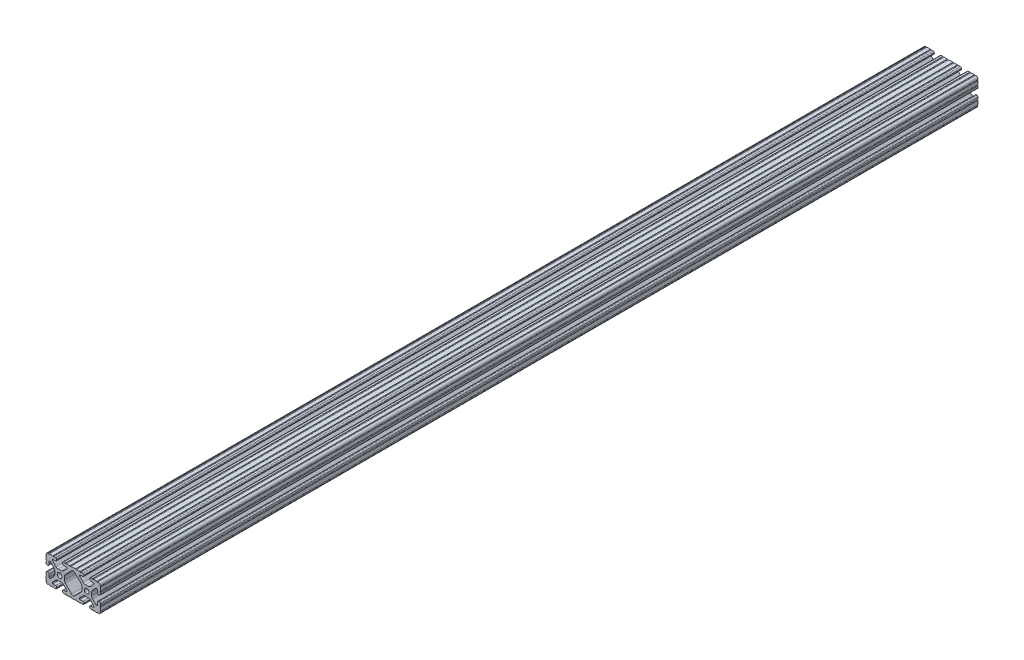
from build123d import *

# Parameters (mm, degrees)
SKETCH1_R      = 3.3274
EXTRUDE1_DEPTH = 1230.3125
SKETCH2_R      = 3.571875
EXTRUDE2_DEPTH = 38.1


with BuildPart() as part:
    # Sketch1 → Extrude1 (new body)
    with BuildSketch(Plane.XY):
        with BuildLine():
            Line((37.1900335, 54.320138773), (37.1900335, 54.882716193))
            ThreePointArc((37.1900335, 54.882716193), (37.450415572, 55.511334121), (38.0790335, 55.771716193))
            Line((38.0790335, 55.771716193), (41.685477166, 55.771716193))
            ThreePointArc((41.685477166, 55.771716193), (42.799028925, 56.232964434), (43.260277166, 57.346516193))
            Line((43.260277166, 57.346516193), (43.260277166, 58.282488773))
            ThreePointArc((43.260277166, 58.282488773), (42.805347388, 59.380786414), (41.707049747, 59.835716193))
            Line((41.707049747, 59.835716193), (39.271813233, 59.835716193))
            ThreePointArc((39.271813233, 59.835716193), (38.509813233, 59.073716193), (37.747813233, 59.835716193))
            Line((37.747813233, 59.835716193), (32.919398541, 59.835716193))
            ThreePointArc((32.919398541, 59.835716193), (32.157398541, 59.073716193), (31.395398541, 59.835716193))
            Line((31.395398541, 59.835716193), (25.153155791, 59.835716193))
            ThreePointArc((25.153155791, 59.835716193), (24.391155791, 59.073716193), (23.629155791, 59.835716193))
            Line((23.629155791, 59.835716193), (18.800741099, 59.835716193))
            ThreePointArc((18.800741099, 59.835716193), (18.038741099, 59.073716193), (17.276741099, 59.835716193))
            Line((17.276741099, 59.835716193), (14.841504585, 59.835716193))
            ThreePointArc((14.841504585, 59.835716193), (13.743206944, 59.380786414), (13.288277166, 58.282488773))
            Line((13.288277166, 58.282488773), (13.288277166, 57.346516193))
            ThreePointArc((13.288277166, 57.346516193), (13.749525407, 56.232964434), (14.863077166, 55.771716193))
            Line((14.863077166, 55.771716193), (18.469520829, 55.771716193))
            ThreePointArc((18.469520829, 55.771716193), (19.098138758, 55.511334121), (19.358520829, 54.882716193))
            Line((19.358520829, 54.882716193), (19.358520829, 54.320138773))
            ThreePointArc((19.358520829, 54.320138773), (19.290850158, 53.979934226), (19.098140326, 53.691522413))
            Line((19.098140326, 53.691522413), (14.421778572, 49.015137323))
            ThreePointArc((14.421778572, 49.015137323), (12.880829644, 47.985503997), (11.063154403, 47.623944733))
            Line((11.063154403, 47.623944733), (7.38539993, 47.623944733))
            ThreePointArc((7.38539993, 47.623944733), (5.567724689, 47.985503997), (4.026775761, 49.015137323))
            Line((4.026775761, 49.015137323), (-0.649585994, 53.691522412))
            ThreePointArc((-0.649585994, 53.691522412), (-0.842295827, 53.979934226), (-0.909966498, 54.320138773))
            Line((-0.909966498, 54.320138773), (-0.909966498, 54.882716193))
            ThreePointArc((-0.909966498, 54.882716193), (-0.649584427, 55.511334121), (-0.020966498, 55.771716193))
            Line((-0.020966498, 55.771716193), (3.585477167, 55.771716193))
            ThreePointArc((3.585477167, 55.771716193), (4.699028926, 56.232964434), (5.160277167, 57.346516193))
            Line((5.160277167, 57.346516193), (5.160277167, 58.266281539))
            ThreePointArc((5.160277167, 58.266281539), (4.744040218, 59.332924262), (3.715361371, 59.835716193))
            Line((3.715361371, 59.835716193), (1.328459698, 59.835716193))
            ThreePointArc((1.328459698, 59.835716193), (0.566459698, 59.073716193), (-0.195540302, 59.835716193))
            Line((-0.195540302, 59.835716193), (-5.021979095, 59.835716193))
            ThreePointArc((-5.021979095, 59.835716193), (-5.807035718, 59.097492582), (-6.545259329, 59.882549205))
            ThreePointArc((-6.545259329, 59.882549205), (-8.87374186, 58.977730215), (-9.863337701, 56.683993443))
            ThreePointArc((-9.863337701, 56.683993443), (-9.063955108, 55.941735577), (-9.825722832, 55.160922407))
            Line((-9.825722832, 55.160922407), (-9.825722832, 50.335417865))
            ThreePointArc((-9.825722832, 50.335417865), (-9.063722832, 49.573417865), (-9.825722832, 48.811417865))
            Line((-9.825722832, 48.811417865), (-9.825722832, 46.424516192))
            ThreePointArc((-9.825722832, 46.424516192), (-9.364474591, 45.310964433), (-8.250922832, 44.849716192))
            Line((-8.250922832, 44.849716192), (-7.336522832, 44.849716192))
            ThreePointArc((-7.336522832, 44.849716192), (-6.222971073, 45.310964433), (-5.761722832, 46.424516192))
            Line((-5.761722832, 46.424516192), (-5.761722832, 50.183716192))
            ThreePointArc((-5.761722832, 50.183716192), (-5.50134076, 50.81233412), (-4.872722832, 51.072716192))
            Line((-4.872722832, 51.072716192), (-4.146379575, 51.072716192))
            ThreePointArc((-4.146379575, 51.072716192), (-3.806172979, 51.005044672), (-3.517760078, 50.812332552))
            Line((-3.517760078, 50.812332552), (1.076701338, 46.217848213))
            ThreePointArc((1.076701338, 46.217848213), (2.10632244, 44.676905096), (2.467877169, 42.859240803))
            Line((2.467877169, 42.859240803), (2.467877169, 38.712191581))
            ThreePointArc((2.467877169, 38.712191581), (2.10632244, 36.894527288), (1.076701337, 35.353584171))
            Line((1.076701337, 35.353584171), (-3.517760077, 30.759099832))
            ThreePointArc((-3.517760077, 30.759099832), (-3.806172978, 30.566387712), (-4.146379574, 30.498716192))
            Line((-4.146379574, 30.498716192), (-4.872722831, 30.498716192))
            ThreePointArc((-4.872722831, 30.498716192), (-5.501340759, 30.759098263), (-5.761722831, 31.387716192))
            Line((-5.761722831, 31.387716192), (-5.761722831, 35.146916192))
            ThreePointArc((-5.761722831, 35.146916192), (-6.222971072, 36.260467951), (-7.336522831, 36.721716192))
            Line((-7.336522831, 36.721716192), (-8.250922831, 36.721716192))
            ThreePointArc((-8.250922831, 36.721716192), (-9.36447459, 36.260467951), (-9.825722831, 35.146916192))
            Line((-9.825722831, 35.146916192), (-9.825722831, 32.760014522))
            ThreePointArc((-9.825722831, 32.760014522), (-9.063722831, 31.998014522), (-9.825722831, 31.236014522))
            Line((-9.825722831, 31.236014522), (-9.825722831, 25.74969698))
            ThreePointArc((-9.825722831, 25.74969698), (-9.063722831, 24.98769698), (-9.825722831, 24.22569698))
            ThreePointArc((-9.825722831, 24.22569698), (-8.934545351, 22.601713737), (-7.296996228, 21.735716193))
            ThreePointArc((-7.296996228, 21.735716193), (-6.534996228, 22.497716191), (-5.77299623, 21.735716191))
            Line((-5.77299623, 21.735716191), (-0.195540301, 21.735716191))
            ThreePointArc((-0.195540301, 21.735716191), (0.566459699, 22.497716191), (1.328459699, 21.735716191))
            Line((1.328459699, 21.735716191), (3.585477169, 21.735716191))
            ThreePointArc((3.585477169, 21.735716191), (4.699028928, 22.196964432), (5.160277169, 23.310516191))
            Line((5.160277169, 23.310516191), (5.160277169, 24.224916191))
            ThreePointArc((5.160277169, 24.224916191), (4.699028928, 25.33846795), (3.585477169, 25.799716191))
            Line((3.585477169, 25.799716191), (-0.173722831, 25.799716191))
            ThreePointArc((-0.173722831, 25.799716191), (-0.80234076, 26.060098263), (-1.062722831, 26.688716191))
            Line((-1.062722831, 26.688716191), (-1.062722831, 27.098536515))
            ThreePointArc((-1.062722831, 27.098536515), (-0.99505216, 27.438741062), (-0.802342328, 27.727152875))
            Line((-0.802342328, 27.727152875), (4.026775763, 32.556295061))
            ThreePointArc((4.026775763, 32.556295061), (5.567724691, 33.585928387), (7.385399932, 33.947487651))
            Line((7.385399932, 33.947487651), (11.063154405, 33.947487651))
            ThreePointArc((11.063154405, 33.947487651), (12.880829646, 33.585928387), (14.421778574, 32.556295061))
            Line((14.421778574, 32.556295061), (19.250896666, 27.727152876))
            ThreePointArc((19.250896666, 27.727152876), (19.443606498, 27.438741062), (19.511277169, 27.098536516))
            Line((19.511277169, 27.098536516), (19.511277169, 26.688716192))
            ThreePointArc((19.511277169, 26.688716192), (19.250895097, 26.060098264), (18.622277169, 25.799716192))
            Line((18.622277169, 25.799716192), (14.863077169, 25.799716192))
            ThreePointArc((14.863077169, 25.799716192), (13.74952541, 25.338467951), (13.288277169, 24.224916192))
            Line((13.288277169, 24.224916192), (13.288277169, 23.310516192))
            ThreePointArc((13.288277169, 23.310516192), (13.74952541, 22.196964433), (14.863077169, 21.735716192))
            Line((14.863077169, 21.735716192), (17.276741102, 21.735716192))
            ThreePointArc((17.276741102, 21.735716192), (18.038741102, 22.497716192), (18.800741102, 21.735716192))
            Line((18.800741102, 21.735716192), (23.629155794, 21.735716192))
            ThreePointArc((23.629155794, 21.735716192), (24.391155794, 22.497716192), (25.153155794, 21.735716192))
            Line((25.153155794, 21.735716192), (31.395398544, 21.735716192))
            ThreePointArc((31.395398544, 21.735716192), (32.157398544, 22.497716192), (32.919398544, 21.735716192))
            Line((32.919398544, 21.735716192), (37.747813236, 21.735716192))
            ThreePointArc((37.747813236, 21.735716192), (38.509813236, 22.497716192), (39.271813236, 21.735716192))
            Line((39.271813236, 21.735716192), (41.685477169, 21.735716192))
            ThreePointArc((41.685477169, 21.735716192), (42.799028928, 22.196964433), (43.260277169, 23.310516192))
            Line((43.260277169, 23.310516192), (43.260277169, 24.224916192))
            ThreePointArc((43.260277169, 24.224916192), (42.799028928, 25.338467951), (41.685477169, 25.799716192))
            Line((41.685477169, 25.799716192), (37.926277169, 25.799716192))
            ThreePointArc((37.926277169, 25.799716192), (37.29765924, 26.060098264), (37.037277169, 26.688716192))
            Line((37.037277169, 26.688716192), (37.037277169, 27.098536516))
            ThreePointArc((37.037277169, 27.098536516), (37.10494784, 27.438741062), (37.297657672, 27.727152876))
            Line((37.297657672, 27.727152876), (42.126775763, 32.556295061))
            ThreePointArc((42.126775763, 32.556295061), (43.667724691, 33.585928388), (45.485399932, 33.947487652))
            Line((45.485399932, 33.947487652), (49.163154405, 33.947487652))
            ThreePointArc((49.163154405, 33.947487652), (50.980829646, 33.585928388), (52.521778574, 32.556295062))
            Line((52.521778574, 32.556295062), (57.350896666, 27.727152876))
            ThreePointArc((57.350896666, 27.727152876), (57.543606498, 27.438741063), (57.611277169, 27.098536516))
            Line((57.611277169, 27.098536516), (57.611277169, 26.688716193))
            ThreePointArc((57.611277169, 26.688716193), (57.350895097, 26.060098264), (56.722277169, 25.799716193))
            Line((56.722277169, 25.799716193), (52.963077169, 25.799716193))
            ThreePointArc((52.963077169, 25.799716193), (51.84952541, 25.338467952), (51.388277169, 24.224916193))
            Line((51.388277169, 24.224916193), (51.388277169, 23.310516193))
            ThreePointArc((51.388277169, 23.310516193), (51.84952541, 22.196964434), (52.963077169, 21.735716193))
            Line((52.963077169, 21.735716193), (55.220094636, 21.735716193))
            ThreePointArc((55.220094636, 21.735716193), (55.982094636, 22.497716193), (56.744094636, 21.735716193))
            Line((56.744094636, 21.735716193), (62.321550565, 21.735716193))
            ThreePointArc((62.321550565, 21.735716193), (63.083550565, 22.497716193), (63.845550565, 21.735716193))
            ThreePointArc((63.845550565, 21.735716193), (65.481854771, 22.602978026), (66.374277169, 24.225696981))
            ThreePointArc((66.374277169, 24.225696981), (65.612277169, 24.987696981), (66.374277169, 25.749696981))
            Line((66.374277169, 25.749696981), (66.374277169, 31.236014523))
            ThreePointArc((66.374277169, 31.236014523), (65.612277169, 31.998014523), (66.374277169, 32.760014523))
            Line((66.374277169, 32.760014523), (66.374277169, 35.146916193))
            ThreePointArc((66.374277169, 35.146916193), (65.913028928, 36.260467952), (64.799477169, 36.721716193))
            Line((64.799477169, 36.721716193), (63.885077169, 36.721716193))
            ThreePointArc((63.885077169, 36.721716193), (62.77152541, 36.260467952), (62.310277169, 35.146916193))
            Line((62.310277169, 35.146916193), (62.310277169, 31.387716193))
            ThreePointArc((62.310277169, 31.387716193), (62.049895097, 30.759098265), (61.421277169, 30.498716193))
            Line((61.421277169, 30.498716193), (60.694933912, 30.498716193))
            ThreePointArc((60.694933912, 30.498716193), (60.354727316, 30.566387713), (60.066314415, 30.759099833))
            Line((60.066314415, 30.759099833), (55.471853, 35.353584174))
            ThreePointArc((55.471853, 35.353584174), (54.442231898, 36.894527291), (54.08067717, 38.712191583))
            Line((54.08067717, 38.712191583), (54.08067717, 42.859240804))
            ThreePointArc((54.08067717, 42.859240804), (54.442231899, 44.676905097), (55.471853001, 46.217848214))
            Line((55.471853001, 46.217848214), (60.066314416, 50.812332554))
            ThreePointArc((60.066314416, 50.812332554), (60.354727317, 51.005044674), (60.694933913, 51.072716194))
            Line((60.694933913, 51.072716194), (61.42127717, 51.072716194))
            ThreePointArc((61.42127717, 51.072716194), (62.049895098, 50.812334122), (62.31027717, 50.183716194))
            Line((62.31027717, 50.183716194), (62.31027717, 46.424516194))
            ThreePointArc((62.31027717, 46.424516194), (62.771525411, 45.310964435), (63.88507717, 44.849716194))
            Line((63.88507717, 44.849716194), (64.79947717, 44.849716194))
            ThreePointArc((64.79947717, 44.849716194), (65.913028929, 45.310964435), (66.37427717, 46.424516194))
            Line((66.37427717, 46.424516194), (66.37427717, 48.811417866))
            ThreePointArc((66.37427717, 48.811417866), (65.61227717, 49.573417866), (66.37427717, 50.335417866))
            Line((66.37427717, 50.335417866), (66.37427717, 55.160922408))
            ThreePointArc((66.37427717, 55.160922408), (65.612509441, 55.941735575), (66.411892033, 56.683993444))
            ThreePointArc((66.411892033, 56.683993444), (65.422296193, 58.977730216), (63.093813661, 59.882549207))
            ThreePointArc((63.093813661, 59.882549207), (62.355590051, 59.097492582), (61.570533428, 59.835716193))
            Line((61.570533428, 59.835716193), (56.744094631, 59.835716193))
            ThreePointArc((56.744094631, 59.835716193), (55.982094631, 59.073716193), (55.220094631, 59.835716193))
            Line((55.220094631, 59.835716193), (52.833192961, 59.835716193))
            ThreePointArc((52.833192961, 59.835716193), (51.804514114, 59.332924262), (51.388277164, 58.266281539))
            Line((51.388277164, 58.266281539), (51.388277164, 57.346516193))
            ThreePointArc((51.388277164, 57.346516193), (51.849525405, 56.232964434), (52.963077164, 55.771716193))
            Line((52.963077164, 55.771716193), (56.569520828, 55.771716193))
            ThreePointArc((56.569520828, 55.771716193), (57.198138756, 55.511334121), (57.458520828, 54.882716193))
            Line((57.458520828, 54.882716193), (57.458520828, 54.320138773))
            ThreePointArc((57.458520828, 54.320138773), (57.390850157, 53.979934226), (57.198140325, 53.691522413))
            Line((57.198140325, 53.691522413), (52.52177857, 49.015137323))
            ThreePointArc((52.52177857, 49.015137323), (50.980829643, 47.985503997), (49.163154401, 47.623944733))
            Line((49.163154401, 47.623944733), (45.485399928, 47.623944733))
            ThreePointArc((45.485399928, 47.623944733), (43.667724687, 47.985503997), (42.12677576, 49.015137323))
            Line((42.12677576, 49.015137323), (37.450414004, 53.691522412))
            ThreePointArc((37.450414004, 53.691522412), (37.257704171, 53.979934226), (37.1900335, 54.320138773))
        make_face()
        with Locations((47.324277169, 40.785716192)):
            Circle(SKETCH1_R, mode=Mode.SUBTRACT)
        with Locations((9.224277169, 40.785716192)):
            Circle(SKETCH1_R, mode=Mode.SUBTRACT)
        with BuildLine():
            Line((30.35131253, 26.52815133), (39.176701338, 35.353584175))
            ThreePointArc((39.176701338, 35.353584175), (40.206322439, 36.894527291), (40.567877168, 38.712191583))
            Line((40.567877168, 38.712191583), (40.567877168, 42.859240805))
            ThreePointArc((40.567877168, 42.859240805), (40.206322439, 44.676905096), (39.176701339, 46.217848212))
            Line((39.176701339, 46.217848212), (30.35131253, 55.043281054))
            ThreePointArc((30.35131253, 55.043281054), (29.39832277, 55.678689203), (28.274277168, 55.898812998))
            ThreePointArc((28.274277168, 55.898812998), (27.150231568, 55.678689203), (26.197241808, 55.043281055))
            Line((26.197241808, 55.043281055), (17.371853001, 46.217848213))
            ThreePointArc((17.371853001, 46.217848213), (16.342231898, 44.676905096), (15.980677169, 42.859240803))
            Line((15.980677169, 42.859240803), (15.980677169, 38.712191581))
            ThreePointArc((15.980677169, 38.712191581), (16.342231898, 36.894527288), (17.371853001, 35.353584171))
            Line((17.371853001, 35.353584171), (26.197241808, 26.528151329))
            ThreePointArc((26.197241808, 26.528151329), (27.150231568, 25.892743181), (28.274277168, 25.672619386))
            ThreePointArc((28.274277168, 25.672619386), (29.39832277, 25.892743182), (30.35131253, 26.52815133))
        make_face(mode=Mode.SUBTRACT)
    extrude(amount=EXTRUDE1_DEPTH)

    # Sketch2 → Extrude2 (cut)
    with BuildSketch(Plane.XZ.offset(-21.735716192)):
        with Locations(Location((9.224277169, 1147.7625, 0), (0, 0, 300.985509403))):
            Circle(SKETCH2_R)
        with Locations(Location((47.324277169, 1147.7625, 0), (0, 0, 300.985509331))):
            Circle(SKETCH2_R)
        with Locations(Location((47.324277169, 792.1625, 0), (0, 0, 300.985509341))):
            Circle(SKETCH2_R)
        with Locations(Location((47.324277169, 754.0625, 0), (0, 0, 300.985509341))):
            Circle(SKETCH2_R)
        with Locations(Location((9.224277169, 42.8625, 0), (0, 0, 300.985509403))):
            Circle(SKETCH2_R)
        with Locations(Location((47.324277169, 42.8625, 0), (0, 0, 300.985509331))):
            Circle(SKETCH2_R)
    extrude(amount=-EXTRUDE2_DEPTH, mode=Mode.SUBTRACT)


solid = part.part
